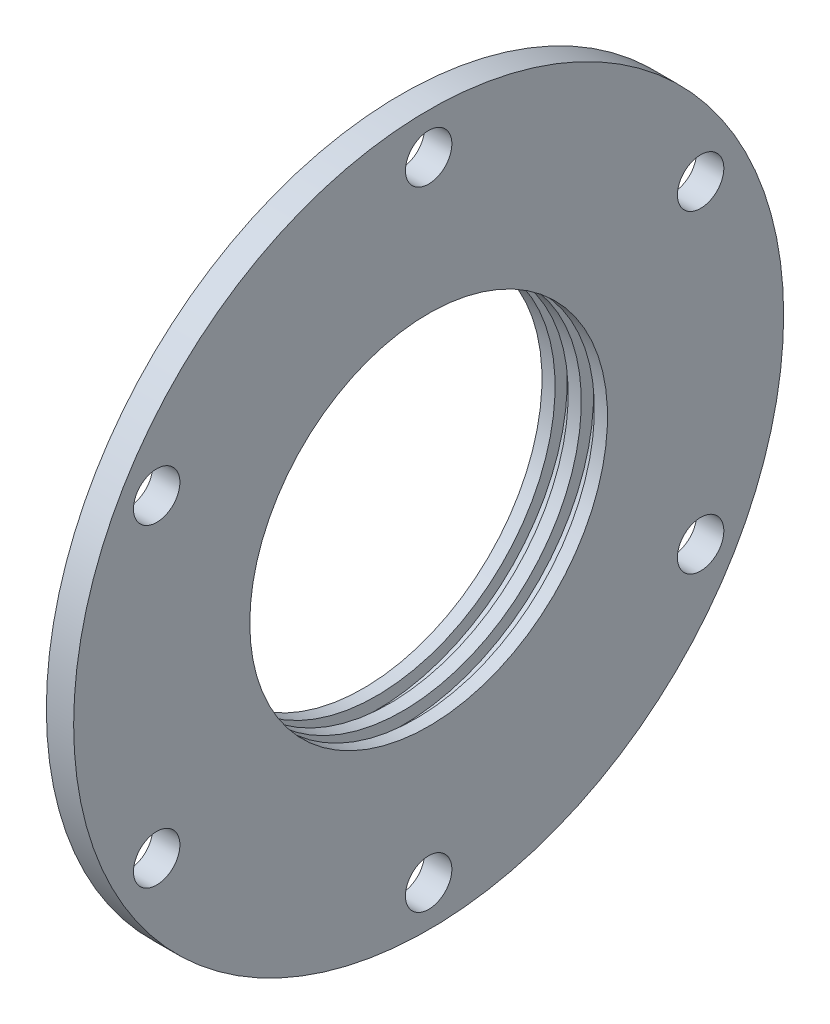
ISO-10303-21;
HEADER;
FILE_DESCRIPTION(('STEP AP214'),'2;1');
FILE_NAME('part.step','',(''),(''),'','','');
FILE_SCHEMA(('AUTOMOTIVE_DESIGN { 1 0 10303 214 1 1 1 1 }'));
ENDSEC;
DATA;
#1=APPLICATION_CONTEXT('core data for automotive mechanical design processes');
#2=APPLICATION_PROTOCOL_DEFINITION('international standard','automotive_design',2000,#1);
#3=PRODUCT_CONTEXT('',#1,'mechanical');
#4=PRODUCT('Part','Part','',(#3));
#5=PRODUCT_RELATED_PRODUCT_CATEGORY('part','',(#4));
#6=PRODUCT_DEFINITION_FORMATION('','',#4);
#7=PRODUCT_DEFINITION_CONTEXT('part definition',#1,'design');
#8=PRODUCT_DEFINITION('design','',#6,#7);
#9=PRODUCT_DEFINITION_SHAPE('','',#8);
#10=(LENGTH_UNIT() NAMED_UNIT(*) SI_UNIT(.MILLI.,.METRE.));
#11=(NAMED_UNIT(*) PLANE_ANGLE_UNIT() SI_UNIT($,.RADIAN.));
#12=(NAMED_UNIT(*) SI_UNIT($,.STERADIAN.) SOLID_ANGLE_UNIT());
#13=UNCERTAINTY_MEASURE_WITH_UNIT(LENGTH_MEASURE(1.E-05),#10,'distance_accuracy_value','');
#14=(GEOMETRIC_REPRESENTATION_CONTEXT(3) GLOBAL_UNCERTAINTY_ASSIGNED_CONTEXT((#13)) GLOBAL_UNIT_ASSIGNED_CONTEXT((#10,
#11,#12)) REPRESENTATION_CONTEXT('',''));
#15=CARTESIAN_POINT('',(0.,0.,0.));
#16=DIRECTION('',(0.,0.,1.));
#17=DIRECTION('',(1.,0.,0.));
#18=AXIS2_PLACEMENT_3D('',#15,#16,#17);
#19=CARTESIAN_POINT('',(-15.1011722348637,0.,0.));
#20=DIRECTION('',(-1.,0.,0.));
#21=DIRECTION('',(0.,0.,1.));
#22=AXIS2_PLACEMENT_3D('',#19,#20,#21);
#23=CYLINDRICAL_SURFACE('',#22,42.5);
#24=CARTESIAN_POINT('',(-4.99999999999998,0.,0.));
#25=DIRECTION('',(1.,0.,0.));
#26=DIRECTION('',(0.,0.,-1.));
#27=AXIS2_PLACEMENT_3D('',#24,#25,#26);
#28=CIRCLE('',#27,42.5);
#29=CARTESIAN_POINT('',(-4.99999999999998,0.,-42.5));
#30=VERTEX_POINT('',#29);
#31=EDGE_CURVE('E10',#30,#30,#28,.T.);
#32=ORIENTED_EDGE('',*,*,#31,.T.);
#33=EDGE_LOOP('',(#32));
#34=FACE_BOUND('',#33,.T.);
#35=CARTESIAN_POINT('',(0.,0.,0.));
#36=DIRECTION('',(-1.,0.,0.));
#37=DIRECTION('',(0.,0.,1.));
#38=AXIS2_PLACEMENT_3D('',#35,#36,#37);
#39=CIRCLE('',#38,42.5);
#40=CARTESIAN_POINT('',(0.,0.,42.5));
#41=VERTEX_POINT('',#40);
#42=EDGE_CURVE('E461',#41,#41,#39,.T.);
#43=ORIENTED_EDGE('',*,*,#42,.T.);
#44=EDGE_LOOP('',(#43));
#45=FACE_BOUND('',#44,.T.);
#46=ADVANCED_FACE('F451',(#34,#45),#23,.T.);
#47=CARTESIAN_POINT('',(0.,42.5,0.));
#48=DIRECTION('',(1.,0.,0.));
#49=DIRECTION('',(0.,0.,-1.));
#50=AXIS2_PLACEMENT_3D('',#47,#48,#49);
#51=PLANE('',#50);
#52=CARTESIAN_POINT('',(0.,28.7500000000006,-49.7964607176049));
#53=DIRECTION('',(1.,0.,0.));
#54=DIRECTION('',(0.,0.,-1.));
#55=AXIS2_PLACEMENT_3D('',#52,#53,#54);
#56=CIRCLE('',#55,4.25);
#57=CARTESIAN_POINT('',(0.,28.7500000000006,-54.0464607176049));
#58=VERTEX_POINT('',#57);
#59=EDGE_CURVE('E533',#58,#58,#56,.T.);
#60=ORIENTED_EDGE('',*,*,#59,.T.);
#61=EDGE_LOOP('',(#60));
#62=FACE_BOUND('',#61,.T.);
#63=CARTESIAN_POINT('',(0.,-28.7499999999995,-49.7964607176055));
#64=DIRECTION('',(1.,0.,0.));
#65=DIRECTION('',(0.,0.,-1.));
#66=AXIS2_PLACEMENT_3D('',#63,#64,#65);
#67=CIRCLE('',#66,4.25);
#68=CARTESIAN_POINT('',(0.,-28.7499999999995,-54.0464607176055));
#69=VERTEX_POINT('',#68);
#70=EDGE_CURVE('E527',#69,#69,#67,.T.);
#71=ORIENTED_EDGE('',*,*,#70,.T.);
#72=EDGE_LOOP('',(#71));
#73=FACE_BOUND('',#72,.T.);
#74=CARTESIAN_POINT('',(0.,-57.5,-4.01520586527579E-13));
#75=DIRECTION('',(1.,0.,0.));
#76=DIRECTION('',(0.,0.,-1.));
#77=AXIS2_PLACEMENT_3D('',#74,#75,#76);
#78=CIRCLE('',#77,4.25);
#79=CARTESIAN_POINT('',(0.,-57.5,-4.2500000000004));
#80=VERTEX_POINT('',#79);
#81=EDGE_CURVE('E521',#80,#80,#78,.T.);
#82=ORIENTED_EDGE('',*,*,#81,.T.);
#83=EDGE_LOOP('',(#82));
#84=FACE_BOUND('',#83,.T.);
#85=CARTESIAN_POINT('',(0.,-28.7500000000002,49.7964607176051));
#86=DIRECTION('',(1.,0.,0.));
#87=DIRECTION('',(0.,0.,-1.));
#88=AXIS2_PLACEMENT_3D('',#85,#86,#87);
#89=CIRCLE('',#88,4.25);
#90=CARTESIAN_POINT('',(0.,-28.7500000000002,45.5464607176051));
#91=VERTEX_POINT('',#90);
#92=EDGE_CURVE('E515',#91,#91,#89,.T.);
#93=ORIENTED_EDGE('',*,*,#92,.T.);
#94=EDGE_LOOP('',(#93));
#95=FACE_BOUND('',#94,.T.);
#96=CARTESIAN_POINT('',(0.,28.7499999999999,49.7964607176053));
#97=DIRECTION('',(1.,0.,0.));
#98=DIRECTION('',(0.,0.,-1.));
#99=AXIS2_PLACEMENT_3D('',#96,#97,#98);
#100=CIRCLE('',#99,4.25);
#101=CARTESIAN_POINT('',(0.,28.7499999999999,45.5464607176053));
#102=VERTEX_POINT('',#101);
#103=EDGE_CURVE('E509',#102,#102,#100,.T.);
#104=ORIENTED_EDGE('',*,*,#103,.T.);
#105=EDGE_LOOP('',(#104));
#106=FACE_BOUND('',#105,.T.);
#107=CARTESIAN_POINT('',(0.,57.5,0.));
#108=DIRECTION('',(1.,0.,0.));
#109=DIRECTION('',(0.,0.,-1.));
#110=AXIS2_PLACEMENT_3D('',#107,#108,#109);
#111=CIRCLE('',#110,4.25);
#112=CARTESIAN_POINT('',(0.,57.5,-4.25));
#113=VERTEX_POINT('',#112);
#114=EDGE_CURVE('E503',#113,#113,#111,.T.);
#115=ORIENTED_EDGE('',*,*,#114,.T.);
#116=EDGE_LOOP('',(#115));
#117=FACE_BOUND('',#116,.T.);
#118=ORIENTED_EDGE('',*,*,#42,.F.);
#119=EDGE_LOOP('',(#118));
#120=FACE_BOUND('',#119,.T.);
#121=CARTESIAN_POINT('',(0.,0.,0.));
#122=DIRECTION('',(-1.,0.,0.));
#123=DIRECTION('',(0.,0.,1.));
#124=AXIS2_PLACEMENT_3D('',#121,#122,#123);
#125=CIRCLE('',#124,65.);
#126=CARTESIAN_POINT('',(0.,0.,65.));
#127=VERTEX_POINT('',#126);
#128=EDGE_CURVE('E465',#127,#127,#125,.T.);
#129=ORIENTED_EDGE('',*,*,#128,.T.);
#130=EDGE_LOOP('',(#129));
#131=FACE_BOUND('',#130,.T.);
#132=ADVANCED_FACE('F627',(#62,#73,#84,#95,#106,#117,#120,#131),#51,.F.);
#133=CARTESIAN_POINT('',(-15.1011722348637,0.,0.));
#134=DIRECTION('',(-1.,0.,0.));
#135=DIRECTION('',(0.,0.,1.));
#136=AXIS2_PLACEMENT_3D('',#133,#134,#135);
#137=CYLINDRICAL_SURFACE('',#136,65.);
#138=ORIENTED_EDGE('',*,*,#128,.F.);
#139=EDGE_LOOP('',(#138));
#140=FACE_BOUND('',#139,.T.);
#141=CARTESIAN_POINT('',(5.,0.,0.));
#142=DIRECTION('',(-1.,0.,0.));
#143=DIRECTION('',(0.,0.,1.));
#144=AXIS2_PLACEMENT_3D('',#141,#142,#143);
#145=CIRCLE('',#144,65.);
#146=CARTESIAN_POINT('',(5.,0.,65.));
#147=VERTEX_POINT('',#146);
#148=EDGE_CURVE('E470',#147,#147,#145,.T.);
#149=ORIENTED_EDGE('',*,*,#148,.T.);
#150=EDGE_LOOP('',(#149));
#151=FACE_BOUND('',#150,.T.);
#152=ADVANCED_FACE('F547',(#140,#151),#137,.T.);
#153=CARTESIAN_POINT('',(5.,65.,0.));
#154=DIRECTION('',(-1.,0.,0.));
#155=DIRECTION('',(0.,0.,1.));
#156=AXIS2_PLACEMENT_3D('',#153,#154,#155);
#157=PLANE('',#156);
#158=CARTESIAN_POINT('',(5.,28.7500000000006,-49.7964607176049));
#159=DIRECTION('',(1.,0.,0.));
#160=DIRECTION('',(0.,-0.866025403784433,-0.50000000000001));
#161=AXIS2_PLACEMENT_3D('',#158,#159,#160);
#162=CIRCLE('',#161,4.25);
#163=CARTESIAN_POINT('',(5.,25.0693920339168,-51.9214607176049));
#164=VERTEX_POINT('',#163);
#165=EDGE_CURVE('E536',#164,#164,#162,.T.);
#166=ORIENTED_EDGE('',*,*,#165,.F.);
#167=EDGE_LOOP('',(#166));
#168=FACE_BOUND('',#167,.T.);
#169=CARTESIAN_POINT('',(5.,-28.7499999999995,-49.7964607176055));
#170=DIRECTION('',(1.,0.,0.));
#171=DIRECTION('',(0.,-0.866025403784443,0.499999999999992));
#172=AXIS2_PLACEMENT_3D('',#169,#170,#171);
#173=CIRCLE('',#172,4.25);
#174=CARTESIAN_POINT('',(5.,-32.4306079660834,-47.6714607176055));
#175=VERTEX_POINT('',#174);
#176=EDGE_CURVE('E530',#175,#175,#173,.T.);
#177=ORIENTED_EDGE('',*,*,#176,.F.);
#178=EDGE_LOOP('',(#177));
#179=FACE_BOUND('',#178,.T.);
#180=CARTESIAN_POINT('',(5.,-57.5,-4.01520586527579E-13));
#181=DIRECTION('',(1.,0.,0.));
#182=DIRECTION('',(0.,0.,1.));
#183=AXIS2_PLACEMENT_3D('',#180,#181,#182);
#184=CIRCLE('',#183,4.25);
#185=CARTESIAN_POINT('',(5.,-57.5,4.2499999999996));
#186=VERTEX_POINT('',#185);
#187=EDGE_CURVE('E524',#186,#186,#184,.T.);
#188=ORIENTED_EDGE('',*,*,#187,.F.);
#189=EDGE_LOOP('',(#188));
#190=FACE_BOUND('',#189,.T.);
#191=CARTESIAN_POINT('',(5.,-28.7500000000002,49.7964607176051));
#192=DIRECTION('',(1.,0.,0.));
#193=DIRECTION('',(0.,0.866025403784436,0.500000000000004));
#194=AXIS2_PLACEMENT_3D('',#191,#192,#193);
#195=CIRCLE('',#194,4.25);
#196=CARTESIAN_POINT('',(5.,-25.0693920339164,51.9214607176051));
#197=VERTEX_POINT('',#196);
#198=EDGE_CURVE('E518',#197,#197,#195,.T.);
#199=ORIENTED_EDGE('',*,*,#198,.F.);
#200=EDGE_LOOP('',(#199));
#201=FACE_BOUND('',#200,.T.);
#202=CARTESIAN_POINT('',(5.,28.7499999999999,49.7964607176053));
#203=DIRECTION('',(1.,0.,0.));
#204=DIRECTION('',(0.,0.86602540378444,-0.499999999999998));
#205=AXIS2_PLACEMENT_3D('',#202,#203,#204);
#206=CIRCLE('',#205,4.25);
#207=CARTESIAN_POINT('',(5.,32.4306079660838,47.6714607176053));
#208=VERTEX_POINT('',#207);
#209=EDGE_CURVE('E512',#208,#208,#206,.T.);
#210=ORIENTED_EDGE('',*,*,#209,.F.);
#211=EDGE_LOOP('',(#210));
#212=FACE_BOUND('',#211,.T.);
#213=CARTESIAN_POINT('',(5.,57.5,0.));
#214=DIRECTION('',(1.,0.,0.));
#215=DIRECTION('',(0.,0.,-1.));
#216=AXIS2_PLACEMENT_3D('',#213,#214,#215);
#217=CIRCLE('',#216,4.25);
#218=CARTESIAN_POINT('',(5.,57.5,-4.25));
#219=VERTEX_POINT('',#218);
#220=EDGE_CURVE('E506',#219,#219,#217,.T.);
#221=ORIENTED_EDGE('',*,*,#220,.F.);
#222=EDGE_LOOP('',(#221));
#223=FACE_BOUND('',#222,.T.);
#224=ORIENTED_EDGE('',*,*,#148,.F.);
#225=EDGE_LOOP('',(#224));
#226=FACE_BOUND('',#225,.T.);
#227=CARTESIAN_POINT('',(5.,0.,0.));
#228=DIRECTION('',(-1.,0.,0.));
#229=DIRECTION('',(0.,0.,1.));
#230=AXIS2_PLACEMENT_3D('',#227,#228,#229);
#231=CIRCLE('',#230,32.75);
#232=CARTESIAN_POINT('',(5.,0.,32.75));
#233=VERTEX_POINT('',#232);
#234=EDGE_CURVE('E473',#233,#233,#231,.T.);
#235=ORIENTED_EDGE('',*,*,#234,.T.);
#236=EDGE_LOOP('',(#235));
#237=FACE_BOUND('',#236,.T.);
#238=ADVANCED_FACE('F543',(#168,#179,#190,#201,#212,#223,#226,#237),#157,.F.);
#239=CARTESIAN_POINT('',(-15.1011722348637,0.,0.));
#240=DIRECTION('',(-1.,0.,0.));
#241=DIRECTION('',(0.,0.,1.));
#242=AXIS2_PLACEMENT_3D('',#239,#240,#241);
#243=CYLINDRICAL_SURFACE('',#242,32.75);
#244=ORIENTED_EDGE('',*,*,#234,.F.);
#245=EDGE_LOOP('',(#244));
#246=FACE_BOUND('',#245,.T.);
#247=CARTESIAN_POINT('',(2.60000000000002,0.,0.));
#248=DIRECTION('',(-1.,0.,0.));
#249=DIRECTION('',(0.,0.,1.));
#250=AXIS2_PLACEMENT_3D('',#247,#248,#249);
#251=CIRCLE('',#250,32.75);
#252=CARTESIAN_POINT('',(2.60000000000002,0.,32.75));
#253=VERTEX_POINT('',#252);
#254=EDGE_CURVE('E476',#253,#253,#251,.T.);
#255=ORIENTED_EDGE('',*,*,#254,.T.);
#256=EDGE_LOOP('',(#255));
#257=FACE_BOUND('',#256,.T.);
#258=ADVANCED_FACE('F546',(#246,#257),#243,.F.);
#259=CARTESIAN_POINT('',(2.60000000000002,32.75,0.));
#260=DIRECTION('',(1.,0.,0.));
#261=DIRECTION('',(0.,0.,-1.));
#262=AXIS2_PLACEMENT_3D('',#259,#260,#261);
#263=PLANE('',#262);
#264=ORIENTED_EDGE('',*,*,#254,.F.);
#265=EDGE_LOOP('',(#264));
#266=FACE_BOUND('',#265,.T.);
#267=CARTESIAN_POINT('',(2.60000000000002,0.,0.));
#268=DIRECTION('',(-1.,0.,0.));
#269=DIRECTION('',(0.,0.,1.));
#270=AXIS2_PLACEMENT_3D('',#267,#268,#269);
#271=CIRCLE('',#270,35.);
#272=CARTESIAN_POINT('',(2.60000000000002,0.,35.));
#273=VERTEX_POINT('',#272);
#274=EDGE_CURVE('E479',#273,#273,#271,.T.);
#275=ORIENTED_EDGE('',*,*,#274,.T.);
#276=EDGE_LOOP('',(#275));
#277=FACE_BOUND('',#276,.T.);
#278=ADVANCED_FACE('F565',(#266,#277),#263,.F.);
#279=CARTESIAN_POINT('',(-15.1011722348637,0.,0.));
#280=DIRECTION('',(-1.,0.,0.));
#281=DIRECTION('',(0.,0.,1.));
#282=AXIS2_PLACEMENT_3D('',#279,#280,#281);
#283=CYLINDRICAL_SURFACE('',#282,35.);
#284=ORIENTED_EDGE('',*,*,#274,.F.);
#285=EDGE_LOOP('',(#284));
#286=FACE_BOUND('',#285,.T.);
#287=CARTESIAN_POINT('',(0.200000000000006,0.,0.));
#288=DIRECTION('',(-1.,0.,0.));
#289=DIRECTION('',(0.,0.,1.));
#290=AXIS2_PLACEMENT_3D('',#287,#288,#289);
#291=CIRCLE('',#290,35.);
#292=CARTESIAN_POINT('',(0.200000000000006,0.,35.));
#293=VERTEX_POINT('',#292);
#294=EDGE_CURVE('E482',#293,#293,#291,.T.);
#295=ORIENTED_EDGE('',*,*,#294,.T.);
#296=EDGE_LOOP('',(#295));
#297=FACE_BOUND('',#296,.T.);
#298=ADVANCED_FACE('F571',(#286,#297),#283,.F.);
#299=CARTESIAN_POINT('',(0.200000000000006,35.,0.));
#300=DIRECTION('',(-1.,0.,0.));
#301=DIRECTION('',(0.,0.,1.));
#302=AXIS2_PLACEMENT_3D('',#299,#300,#301);
#303=PLANE('',#302);
#304=ORIENTED_EDGE('',*,*,#294,.F.);
#305=EDGE_LOOP('',(#304));
#306=FACE_BOUND('',#305,.T.);
#307=CARTESIAN_POINT('',(0.200000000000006,0.,0.));
#308=DIRECTION('',(-1.,0.,0.));
#309=DIRECTION('',(0.,0.,1.));
#310=AXIS2_PLACEMENT_3D('',#307,#308,#309);
#311=CIRCLE('',#310,32.75);
#312=CARTESIAN_POINT('',(0.200000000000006,0.,32.75));
#313=VERTEX_POINT('',#312);
#314=EDGE_CURVE('E485',#313,#313,#311,.T.);
#315=ORIENTED_EDGE('',*,*,#314,.T.);
#316=EDGE_LOOP('',(#315));
#317=FACE_BOUND('',#316,.T.);
#318=ADVANCED_FACE('F577',(#306,#317),#303,.F.);
#319=CARTESIAN_POINT('',(-15.1011722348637,0.,0.));
#320=DIRECTION('',(-1.,0.,0.));
#321=DIRECTION('',(0.,0.,1.));
#322=AXIS2_PLACEMENT_3D('',#319,#320,#321);
#323=CYLINDRICAL_SURFACE('',#322,32.75);
#324=ORIENTED_EDGE('',*,*,#314,.F.);
#325=EDGE_LOOP('',(#324));
#326=FACE_BOUND('',#325,.T.);
#327=CARTESIAN_POINT('',(-2.20000000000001,0.,0.));
#328=DIRECTION('',(-1.,0.,0.));
#329=DIRECTION('',(0.,0.,1.));
#330=AXIS2_PLACEMENT_3D('',#327,#328,#329);
#331=CIRCLE('',#330,32.75);
#332=CARTESIAN_POINT('',(-2.20000000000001,0.,32.75));
#333=VERTEX_POINT('',#332);
#334=EDGE_CURVE('E488',#333,#333,#331,.T.);
#335=ORIENTED_EDGE('',*,*,#334,.T.);
#336=EDGE_LOOP('',(#335));
#337=FACE_BOUND('',#336,.T.);
#338=ADVANCED_FACE('F583',(#326,#337),#323,.F.);
#339=CARTESIAN_POINT('',(-2.19999999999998,35.,0.));
#340=DIRECTION('',(1.,0.,0.));
#341=DIRECTION('',(0.,0.,-1.));
#342=AXIS2_PLACEMENT_3D('',#339,#340,#341);
#343=PLANE('',#342);
#344=ORIENTED_EDGE('',*,*,#334,.F.);
#345=EDGE_LOOP('',(#344));
#346=FACE_BOUND('',#345,.T.);
#347=CARTESIAN_POINT('',(-2.20000000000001,0.,0.));
#348=DIRECTION('',(-1.,0.,0.));
#349=DIRECTION('',(0.,0.,1.));
#350=AXIS2_PLACEMENT_3D('',#347,#348,#349);
#351=CIRCLE('',#350,35.);
#352=CARTESIAN_POINT('',(-2.20000000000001,0.,35.));
#353=VERTEX_POINT('',#352);
#354=EDGE_CURVE('E491',#353,#353,#351,.T.);
#355=ORIENTED_EDGE('',*,*,#354,.T.);
#356=EDGE_LOOP('',(#355));
#357=FACE_BOUND('',#356,.T.);
#358=ADVANCED_FACE('F589',(#346,#357),#343,.F.);
#359=CARTESIAN_POINT('',(-15.1011722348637,0.,0.));
#360=DIRECTION('',(-1.,0.,0.));
#361=DIRECTION('',(0.,0.,1.));
#362=AXIS2_PLACEMENT_3D('',#359,#360,#361);
#363=CYLINDRICAL_SURFACE('',#362,35.);
#364=ORIENTED_EDGE('',*,*,#354,.F.);
#365=EDGE_LOOP('',(#364));
#366=FACE_BOUND('',#365,.T.);
#367=CARTESIAN_POINT('',(-4.59999999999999,0.,0.));
#368=DIRECTION('',(-1.,0.,0.));
#369=DIRECTION('',(0.,0.,1.));
#370=AXIS2_PLACEMENT_3D('',#367,#368,#369);
#371=CIRCLE('',#370,35.);
#372=CARTESIAN_POINT('',(-4.59999999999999,0.,35.));
#373=VERTEX_POINT('',#372);
#374=EDGE_CURVE('E494',#373,#373,#371,.T.);
#375=ORIENTED_EDGE('',*,*,#374,.T.);
#376=EDGE_LOOP('',(#375));
#377=FACE_BOUND('',#376,.T.);
#378=ADVANCED_FACE('F595',(#366,#377),#363,.F.);
#379=CARTESIAN_POINT('',(-4.59999999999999,35.,0.));
#380=DIRECTION('',(-1.,0.,0.));
#381=DIRECTION('',(0.,0.,1.));
#382=AXIS2_PLACEMENT_3D('',#379,#380,#381);
#383=PLANE('',#382);
#384=ORIENTED_EDGE('',*,*,#374,.F.);
#385=EDGE_LOOP('',(#384));
#386=FACE_BOUND('',#385,.T.);
#387=CARTESIAN_POINT('',(-4.59999999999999,0.,0.));
#388=DIRECTION('',(-1.,0.,0.));
#389=DIRECTION('',(0.,0.,1.));
#390=AXIS2_PLACEMENT_3D('',#387,#388,#389);
#391=CIRCLE('',#390,32.75);
#392=CARTESIAN_POINT('',(-4.59999999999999,0.,32.75));
#393=VERTEX_POINT('',#392);
#394=EDGE_CURVE('E497',#393,#393,#391,.T.);
#395=ORIENTED_EDGE('',*,*,#394,.T.);
#396=EDGE_LOOP('',(#395));
#397=FACE_BOUND('',#396,.T.);
#398=ADVANCED_FACE('F601',(#386,#397),#383,.F.);
#399=CARTESIAN_POINT('',(-15.1011722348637,0.,0.));
#400=DIRECTION('',(-1.,0.,0.));
#401=DIRECTION('',(0.,0.,1.));
#402=AXIS2_PLACEMENT_3D('',#399,#400,#401);
#403=CYLINDRICAL_SURFACE('',#402,32.75);
#404=ORIENTED_EDGE('',*,*,#394,.F.);
#405=EDGE_LOOP('',(#404));
#406=FACE_BOUND('',#405,.T.);
#407=CARTESIAN_POINT('',(-7.00000000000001,0.,0.));
#408=DIRECTION('',(-1.,0.,0.));
#409=DIRECTION('',(0.,0.,1.));
#410=AXIS2_PLACEMENT_3D('',#407,#408,#409);
#411=CIRCLE('',#410,32.75);
#412=CARTESIAN_POINT('',(-7.00000000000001,0.,32.75));
#413=VERTEX_POINT('',#412);
#414=EDGE_CURVE('E500',#413,#413,#411,.T.);
#415=ORIENTED_EDGE('',*,*,#414,.T.);
#416=EDGE_LOOP('',(#415));
#417=FACE_BOUND('',#416,.T.);
#418=ADVANCED_FACE('F607',(#406,#417),#403,.F.);
#419=CARTESIAN_POINT('',(-6.99999999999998,39.,0.));
#420=DIRECTION('',(1.,0.,0.));
#421=DIRECTION('',(0.,0.,-1.));
#422=AXIS2_PLACEMENT_3D('',#419,#420,#421);
#423=PLANE('',#422);
#424=CARTESIAN_POINT('',(-7.00000000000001,0.,0.));
#425=DIRECTION('',(1.,0.,0.));
#426=DIRECTION('',(0.,0.,-1.));
#427=AXIS2_PLACEMENT_3D('',#424,#425,#426);
#428=CIRCLE('',#427,41.3452994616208);
#429=CARTESIAN_POINT('',(-7.00000000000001,0.,-41.3452994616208));
#430=VERTEX_POINT('',#429);
#431=EDGE_CURVE('E457',#430,#430,#428,.F.);
#432=ORIENTED_EDGE('',*,*,#431,.T.);
#433=EDGE_LOOP('',(#432));
#434=FACE_BOUND('',#433,.T.);
#435=ORIENTED_EDGE('',*,*,#414,.F.);
#436=EDGE_LOOP('',(#435));
#437=FACE_BOUND('',#436,.T.);
#438=ADVANCED_FACE('F613',(#434,#437),#423,.F.);
#439=CARTESIAN_POINT('',(-6.99999999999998,57.5,0.));
#440=DIRECTION('',(1.,0.,0.));
#441=DIRECTION('',(0.,0.,-1.));
#442=AXIS2_PLACEMENT_3D('',#439,#440,#441);
#443=CYLINDRICAL_SURFACE('',#442,4.25);
#444=ORIENTED_EDGE('',*,*,#220,.T.);
#445=EDGE_LOOP('',(#444));
#446=FACE_BOUND('',#445,.T.);
#447=ORIENTED_EDGE('',*,*,#114,.F.);
#448=EDGE_LOOP('',(#447));
#449=FACE_BOUND('',#448,.T.);
#450=ADVANCED_FACE('F618',(#446,#449),#443,.F.);
#451=CARTESIAN_POINT('',(-6.99999999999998,28.7499999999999,49.7964607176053));
#452=DIRECTION('',(1.,0.,0.));
#453=DIRECTION('',(0.,0.,-1.));
#454=AXIS2_PLACEMENT_3D('',#451,#452,#453);
#455=CYLINDRICAL_SURFACE('',#454,4.25);
#456=ORIENTED_EDGE('',*,*,#209,.T.);
#457=EDGE_LOOP('',(#456));
#458=FACE_BOUND('',#457,.T.);
#459=ORIENTED_EDGE('',*,*,#103,.F.);
#460=EDGE_LOOP('',(#459));
#461=FACE_BOUND('',#460,.T.);
#462=ADVANCED_FACE('F623',(#458,#461),#455,.F.);
#463=CARTESIAN_POINT('',(-7.00000000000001,-28.7500000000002,49.7964607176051));
#464=DIRECTION('',(1.,0.,0.));
#465=DIRECTION('',(0.,0.,-1.));
#466=AXIS2_PLACEMENT_3D('',#463,#464,#465);
#467=CYLINDRICAL_SURFACE('',#466,4.25);
#468=ORIENTED_EDGE('',*,*,#198,.T.);
#469=EDGE_LOOP('',(#468));
#470=FACE_BOUND('',#469,.T.);
#471=ORIENTED_EDGE('',*,*,#92,.F.);
#472=EDGE_LOOP('',(#471));
#473=FACE_BOUND('',#472,.T.);
#474=ADVANCED_FACE('F701',(#470,#473),#467,.F.);
#475=CARTESIAN_POINT('',(-7.00000000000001,-57.5,-4.01520586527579E-13));
#476=DIRECTION('',(1.,0.,0.));
#477=DIRECTION('',(0.,0.,-1.));
#478=AXIS2_PLACEMENT_3D('',#475,#476,#477);
#479=CYLINDRICAL_SURFACE('',#478,4.25);
#480=ORIENTED_EDGE('',*,*,#187,.T.);
#481=EDGE_LOOP('',(#480));
#482=FACE_BOUND('',#481,.T.);
#483=ORIENTED_EDGE('',*,*,#81,.F.);
#484=EDGE_LOOP('',(#483));
#485=FACE_BOUND('',#484,.T.);
#486=ADVANCED_FACE('F709',(#482,#485),#479,.F.);
#487=CARTESIAN_POINT('',(-7.00000000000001,-28.7499999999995,-49.7964607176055));
#488=DIRECTION('',(1.,0.,0.));
#489=DIRECTION('',(0.,0.,-1.));
#490=AXIS2_PLACEMENT_3D('',#487,#488,#489);
#491=CYLINDRICAL_SURFACE('',#490,4.25);
#492=ORIENTED_EDGE('',*,*,#176,.T.);
#493=EDGE_LOOP('',(#492));
#494=FACE_BOUND('',#493,.T.);
#495=ORIENTED_EDGE('',*,*,#70,.F.);
#496=EDGE_LOOP('',(#495));
#497=FACE_BOUND('',#496,.T.);
#498=ADVANCED_FACE('F717',(#494,#497),#491,.F.);
#499=CARTESIAN_POINT('',(-6.99999999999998,28.7500000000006,-49.7964607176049));
#500=DIRECTION('',(1.,0.,0.));
#501=DIRECTION('',(0.,0.,-1.));
#502=AXIS2_PLACEMENT_3D('',#499,#500,#501);
#503=CYLINDRICAL_SURFACE('',#502,4.25);
#504=ORIENTED_EDGE('',*,*,#165,.T.);
#505=EDGE_LOOP('',(#504));
#506=FACE_BOUND('',#505,.T.);
#507=ORIENTED_EDGE('',*,*,#59,.F.);
#508=EDGE_LOOP('',(#507));
#509=FACE_BOUND('',#508,.T.);
#510=ADVANCED_FACE('F540',(#506,#509),#503,.F.);
#511=CARTESIAN_POINT('',(-7.00000000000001,0.,0.));
#512=DIRECTION('',(1.,0.,0.));
#513=DIRECTION('',(0.,0.,-1.));
#514=AXIS2_PLACEMENT_3D('',#511,#512,#513);
#515=CONICAL_SURFACE('',#514,41.3452994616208,0.523598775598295);
#516=ORIENTED_EDGE('',*,*,#31,.F.);
#517=EDGE_LOOP('',(#516));
#518=FACE_BOUND('',#517,.T.);
#519=ORIENTED_EDGE('',*,*,#431,.F.);
#520=EDGE_LOOP('',(#519));
#521=FACE_BOUND('',#520,.T.);
#522=ADVANCED_FACE('F732',(#518,#521),#515,.T.);
#523=CLOSED_SHELL('',(#46,#132,#152,#238,#258,#278,#298,#318,#338,#358,#378,#398,#418,#438,#450,
#462,#474,#486,#498,#510,#522));
#524=MANIFOLD_SOLID_BREP('B2',#523);
#525=ADVANCED_BREP_SHAPE_REPRESENTATION('',(#18,#524),#14);
#526=SHAPE_DEFINITION_REPRESENTATION(#9,#525);
ENDSEC;
END-ISO-10303-21;
